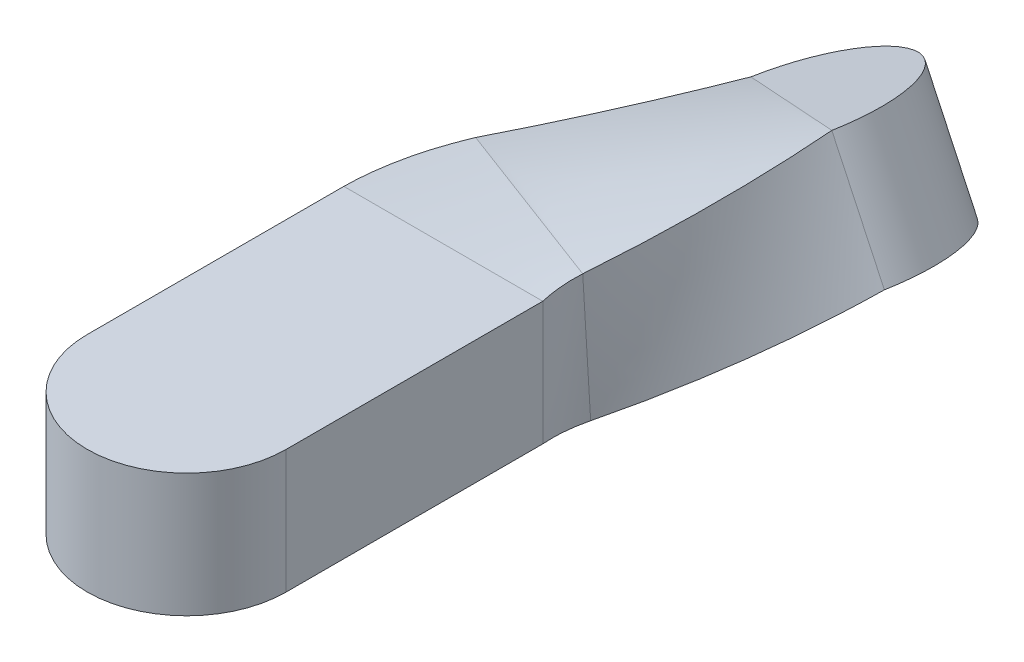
ISO-10303-21;
HEADER;
FILE_DESCRIPTION(('STEP AP214'),'2;1');
FILE_NAME('part.step','',(''),(''),'','','');
FILE_SCHEMA(('AUTOMOTIVE_DESIGN { 1 0 10303 214 1 1 1 1 }'));
ENDSEC;
DATA;
#1=APPLICATION_CONTEXT('core data for automotive mechanical design processes');
#2=APPLICATION_PROTOCOL_DEFINITION('international standard','automotive_design',2000,#1);
#3=PRODUCT_CONTEXT('',#1,'mechanical');
#4=PRODUCT('Part','Part','',(#3));
#5=PRODUCT_RELATED_PRODUCT_CATEGORY('part','',(#4));
#6=PRODUCT_DEFINITION_FORMATION('','',#4);
#7=PRODUCT_DEFINITION_CONTEXT('part definition',#1,'design');
#8=PRODUCT_DEFINITION('design','',#6,#7);
#9=PRODUCT_DEFINITION_SHAPE('','',#8);
#10=(LENGTH_UNIT() NAMED_UNIT(*) SI_UNIT(.MILLI.,.METRE.));
#11=(NAMED_UNIT(*) PLANE_ANGLE_UNIT() SI_UNIT($,.RADIAN.));
#12=(NAMED_UNIT(*) SI_UNIT($,.STERADIAN.) SOLID_ANGLE_UNIT());
#13=UNCERTAINTY_MEASURE_WITH_UNIT(LENGTH_MEASURE(1.E-05),#10,'distance_accuracy_value','');
#14=(GEOMETRIC_REPRESENTATION_CONTEXT(3) GLOBAL_UNCERTAINTY_ASSIGNED_CONTEXT((#13)) GLOBAL_UNIT_ASSIGNED_CONTEXT((#10,
#11,#12)) REPRESENTATION_CONTEXT('',''));
#15=CARTESIAN_POINT('',(0.,0.,0.));
#16=DIRECTION('',(0.,0.,1.));
#17=DIRECTION('',(1.,0.,0.));
#18=AXIS2_PLACEMENT_3D('',#15,#16,#17);
#19=CARTESIAN_POINT('',(4.025,-11.45,-90.8087010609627));
#20=DIRECTION('',(1.,0.,0.));
#21=DIRECTION('',(0.,1.,0.));
#22=AXIS2_PLACEMENT_3D('',#19,#20,#21);
#23=PLANE('',#22);
#24=DIRECTION('',(0.,1.,0.));
#25=VECTOR('',#24,1.);
#26=CARTESIAN_POINT('',(4.025,-11.45,-80.425));
#27=LINE('',#26,#25);
#28=CARTESIAN_POINT('',(4.025,-11.45,-80.425));
#29=VERTEX_POINT('',#28);
#30=CARTESIAN_POINT('',(4.02499999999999,-6.45,-80.425));
#31=VERTEX_POINT('',#30);
#32=EDGE_CURVE('E123',#29,#31,#27,.T.);
#33=ORIENTED_EDGE('',*,*,#32,.F.);
#34=DIRECTION('',(0.,0.,1.));
#35=VECTOR('',#34,1.);
#36=CARTESIAN_POINT('',(4.025,-11.45,-90.8087010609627));
#37=LINE('',#36,#35);
#38=CARTESIAN_POINT('',(4.025,-11.45,-90.8087010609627));
#39=VERTEX_POINT('',#38);
#40=EDGE_CURVE('E11',#39,#29,#37,.T.);
#41=ORIENTED_EDGE('',*,*,#40,.F.);
#42=CARTESIAN_POINT('',(4.02499999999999,-6.45,-90.8087010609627));
#43=CARTESIAN_POINT('',(4.02499999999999,-8.11666666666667,-90.8087010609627));
#44=CARTESIAN_POINT('',(4.025,-9.78333333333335,-90.8087010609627));
#45=CARTESIAN_POINT('',(4.025,-11.45,-90.8087010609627));
#46=B_SPLINE_CURVE_WITH_KNOTS('',3,(#42,#43,#44,#45),.UNSPECIFIED.,.F.,.F.,(4,4),(0.,1.),.UNSPECIFIED.);
#47=CARTESIAN_POINT('',(4.02499999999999,-6.45,-90.8087010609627));
#48=VERTEX_POINT('',#47);
#49=EDGE_CURVE('E122',#39,#48,#46,.F.);
#50=ORIENTED_EDGE('',*,*,#49,.T.);
#51=DIRECTION('',(0.,0.,1.));
#52=VECTOR('',#51,1.);
#53=CARTESIAN_POINT('',(4.02499999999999,-6.45,-90.8087010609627));
#54=LINE('',#53,#52);
#55=EDGE_CURVE('E133',#48,#31,#54,.T.);
#56=ORIENTED_EDGE('',*,*,#55,.T.);
#57=EDGE_LOOP('',(#33,#41,#50,#56));
#58=FACE_BOUND('',#57,.T.);
#59=ADVANCED_FACE('F33',(#58),#23,.T.);
#60=CARTESIAN_POINT('',(-4.025,-11.45,-90.8087010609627));
#61=DIRECTION('',(0.,-1.,0.));
#62=DIRECTION('',(1.,0.,0.));
#63=AXIS2_PLACEMENT_3D('',#60,#61,#62);
#64=PLANE('',#63);
#65=ORIENTED_EDGE('',*,*,#40,.T.);
#66=CARTESIAN_POINT('',(0.,-11.45,-80.425));
#67=DIRECTION('',(0.,1.,0.));
#68=DIRECTION('',(-1.,0.,0.));
#69=AXIS2_PLACEMENT_3D('',#66,#67,#68);
#70=CIRCLE('',#69,4.025);
#71=CARTESIAN_POINT('',(-4.025,-11.45,-80.425));
#72=VERTEX_POINT('',#71);
#73=EDGE_CURVE('E137',#72,#29,#70,.T.);
#74=ORIENTED_EDGE('',*,*,#73,.F.);
#75=DIRECTION('',(0.,0.,1.));
#76=VECTOR('',#75,1.);
#77=CARTESIAN_POINT('',(-4.025,-11.45,-90.8087010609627));
#78=LINE('',#77,#76);
#79=CARTESIAN_POINT('',(-4.025,-11.45,-90.8087010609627));
#80=VERTEX_POINT('',#79);
#81=EDGE_CURVE('E43',#80,#72,#78,.T.);
#82=ORIENTED_EDGE('',*,*,#81,.F.);
#83=CARTESIAN_POINT('',(4.025,-11.45,-90.8087010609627));
#84=CARTESIAN_POINT('',(1.34166666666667,-11.45,-90.8087010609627));
#85=CARTESIAN_POINT('',(-1.34166666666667,-11.45,-90.8087010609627));
#86=CARTESIAN_POINT('',(-4.025,-11.45,-90.8087010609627));
#87=B_SPLINE_CURVE_WITH_KNOTS('',3,(#83,#84,#85,#86),.UNSPECIFIED.,.F.,.F.,(4,4),(0.,1.),.UNSPECIFIED.);
#88=EDGE_CURVE('E313',#80,#39,#87,.F.);
#89=ORIENTED_EDGE('',*,*,#88,.T.);
#90=EDGE_LOOP('',(#65,#74,#82,#89));
#91=FACE_BOUND('',#90,.T.);
#92=ADVANCED_FACE('F442',(#91),#64,.T.);
#93=CARTESIAN_POINT('',(-4.025,-11.45,-90.8087010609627));
#94=DIRECTION('',(-1.,0.,0.));
#95=DIRECTION('',(0.,0.,1.));
#96=AXIS2_PLACEMENT_3D('',#93,#94,#95);
#97=PLANE('',#96);
#98=DIRECTION('',(0.,-1.,0.));
#99=VECTOR('',#98,1.);
#100=CARTESIAN_POINT('',(-4.025,-11.45,-80.425));
#101=LINE('',#100,#99);
#102=CARTESIAN_POINT('',(-4.025,-6.45000000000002,-80.425));
#103=VERTEX_POINT('',#102);
#104=EDGE_CURVE('E111',#103,#72,#101,.T.);
#105=ORIENTED_EDGE('',*,*,#104,.F.);
#106=DIRECTION('',(0.,0.,1.));
#107=VECTOR('',#106,1.);
#108=CARTESIAN_POINT('',(-4.025,-6.45,-90.8087010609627));
#109=LINE('',#108,#107);
#110=CARTESIAN_POINT('',(-4.025,-6.45,-90.8087010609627));
#111=VERTEX_POINT('',#110);
#112=EDGE_CURVE('E115',#111,#103,#109,.T.);
#113=ORIENTED_EDGE('',*,*,#112,.F.);
#114=CARTESIAN_POINT('',(-4.025,-11.45,-90.8087010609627));
#115=CARTESIAN_POINT('',(-4.025,-9.78333333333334,-90.8087010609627));
#116=CARTESIAN_POINT('',(-4.025,-8.11666666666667,-90.8087010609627));
#117=CARTESIAN_POINT('',(-4.025,-6.45,-90.8087010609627));
#118=B_SPLINE_CURVE_WITH_KNOTS('',3,(#114,#115,#116,#117),.UNSPECIFIED.,.F.,.F.,(4,4),(0.,1.),.UNSPECIFIED.);
#119=EDGE_CURVE('E361',#111,#80,#118,.F.);
#120=ORIENTED_EDGE('',*,*,#119,.T.);
#121=ORIENTED_EDGE('',*,*,#81,.T.);
#122=EDGE_LOOP('',(#105,#113,#120,#121));
#123=FACE_BOUND('',#122,.T.);
#124=ADVANCED_FACE('F113',(#123),#97,.T.);
#125=CARTESIAN_POINT('',(-4.025,-6.45,-90.8087010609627));
#126=DIRECTION('',(0.,1.,0.));
#127=DIRECTION('',(-1.,0.,0.));
#128=AXIS2_PLACEMENT_3D('',#125,#126,#127);
#129=PLANE('',#128);
#130=ORIENTED_EDGE('',*,*,#112,.T.);
#131=CARTESIAN_POINT('',(0.,-6.45000000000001,-80.425));
#132=DIRECTION('',(0.,1.,0.));
#133=DIRECTION('',(-1.,0.,0.));
#134=AXIS2_PLACEMENT_3D('',#131,#132,#133);
#135=CIRCLE('',#134,4.02499999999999);
#136=EDGE_CURVE('E129',#103,#31,#135,.T.);
#137=ORIENTED_EDGE('',*,*,#136,.T.);
#138=ORIENTED_EDGE('',*,*,#55,.F.);
#139=CARTESIAN_POINT('',(-4.025,-6.45,-90.8087010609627));
#140=CARTESIAN_POINT('',(-1.34166666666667,-6.45,-90.8087010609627));
#141=CARTESIAN_POINT('',(1.34166666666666,-6.45,-90.8087010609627));
#142=CARTESIAN_POINT('',(4.02499999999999,-6.45,-90.8087010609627));
#143=B_SPLINE_CURVE_WITH_KNOTS('',3,(#139,#140,#141,#142),.UNSPECIFIED.,.F.,.F.,(4,4),(0.,1.),.UNSPECIFIED.);
#144=EDGE_CURVE('E131',#48,#111,#143,.F.);
#145=ORIENTED_EDGE('',*,*,#144,.T.);
#146=EDGE_LOOP('',(#130,#137,#138,#145));
#147=FACE_BOUND('',#146,.T.);
#148=ADVANCED_FACE('F127',(#147),#129,.T.);
#149=CARTESIAN_POINT('',(-3.29638967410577,-6.67502698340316,-95.4131763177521));
#150=CARTESIAN_POINT('',(-3.82171973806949,-6.62495802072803,-93.9925323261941));
#151=CARTESIAN_POINT('',(-4.08845512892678,-6.53373996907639,-92.42721719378));
#152=CARTESIAN_POINT('',(-4.025,-6.45,-90.8087010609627));
#153=CARTESIAN_POINT('',(-0.823158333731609,-6.51616543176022,-94.384503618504));
#154=CARTESIAN_POINT('',(-1.21485130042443,-6.51340910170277,-93.2779823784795));
#155=CARTESIAN_POINT('',(-1.40506565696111,-6.47788863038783,-92.0761100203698));
#156=CARTESIAN_POINT('',(-1.34166666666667,-6.45,-90.8087010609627));
#157=CARTESIAN_POINT('',(1.65007300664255,-6.35730388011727,-93.3558309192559));
#158=CARTESIAN_POINT('',(1.39196207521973,-6.40176205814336,-92.563410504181));
#159=CARTESIAN_POINT('',(1.27837052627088,-6.42215661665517,-91.7249459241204));
#160=CARTESIAN_POINT('',(1.34166666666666,-6.45,-90.8087010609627));
#161=CARTESIAN_POINT('',(4.1233043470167,-6.19844232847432,-92.3271582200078));
#162=CARTESIAN_POINT('',(3.9986012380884,-6.28985338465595,-91.84870249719));
#163=CARTESIAN_POINT('',(3.96194182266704,-6.36678387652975,-91.3737057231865));
#164=CARTESIAN_POINT('',(4.02499999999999,-6.45,-90.8087010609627));
#165=B_SPLINE_SURFACE_WITH_KNOTS('',3,3,((#149,#150,#151,#152),(#153,#154,#155,#156),(#157,#158,
#159,#160),(#161,#162,#163,#164)),.UNSPECIFIED.,.F.,.F.,.F.,(4,4),(4,4),(0.,1.),(0.,1.),.UNSPECIFIED.);
#166=CARTESIAN_POINT('',(4.1233043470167,-6.19844232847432,-92.3271582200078));
#167=CARTESIAN_POINT('',(3.9986012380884,-6.28985338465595,-91.84870249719));
#168=CARTESIAN_POINT('',(3.96194182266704,-6.36678387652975,-91.3737057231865));
#169=CARTESIAN_POINT('',(4.02499999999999,-6.45,-90.8087010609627));
#170=B_SPLINE_CURVE_WITH_KNOTS('',3,(#166,#167,#168,#169),.UNSPECIFIED.,.F.,.F.,(4,4),(0.,1.),.UNSPECIFIED.);
#171=CARTESIAN_POINT('',(4.1233043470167,-6.19844232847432,-92.3271582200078));
#172=VERTEX_POINT('',#171);
#173=EDGE_CURVE('E308',#172,#48,#170,.T.);
#174=DIRECTION('',(0.921701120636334,0.0592030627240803,0.383356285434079));
#175=VECTOR('',#174,1.);
#176=CARTESIAN_POINT('',(-3.29638967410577,-6.67502698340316,-95.4131763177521));
#177=LINE('',#176,#175);
#178=CARTESIAN_POINT('',(-3.29638967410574,-6.67502698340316,-95.4131763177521));
#179=VERTEX_POINT('',#178);
#180=EDGE_CURVE('E408',#179,#172,#177,.T.);
#181=CARTESIAN_POINT('',(-3.29638967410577,-6.67502698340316,-95.4131763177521));
#182=CARTESIAN_POINT('',(-3.82171973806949,-6.62495802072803,-93.9925323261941));
#183=CARTESIAN_POINT('',(-4.08845512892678,-6.53373996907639,-92.42721719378));
#184=CARTESIAN_POINT('',(-4.025,-6.45,-90.8087010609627));
#185=B_SPLINE_CURVE_WITH_KNOTS('',3,(#181,#182,#183,#184),.UNSPECIFIED.,.F.,.F.,(4,4),(0.,1.),.UNSPECIFIED.);
#186=EDGE_CURVE('E273',#179,#111,#185,.T.);
#187=ORIENTED_EDGE('',*,*,#173,.F.);
#188=ORIENTED_EDGE('',*,*,#180,.F.);
#189=ORIENTED_EDGE('',*,*,#186,.T.);
#190=ORIENTED_EDGE('',*,*,#144,.F.);
#191=EDGE_LOOP('',(#187,#188,#189,#190));
#192=FACE_BOUND('',#191,.T.);
#193=ADVANCED_FACE('F227',(#192),#165,.F.);
#194=CARTESIAN_POINT('',(4.1233043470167,-6.19844232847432,-92.3271582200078));
#195=CARTESIAN_POINT('',(3.9986012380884,-6.28985338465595,-91.84870249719));
#196=CARTESIAN_POINT('',(3.96194182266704,-6.36678387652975,-91.3737057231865));
#197=CARTESIAN_POINT('',(4.02499999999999,-6.45,-90.8087010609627));
#198=CARTESIAN_POINT('',(4.23013844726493,-7.8616814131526,-92.3271589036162));
#199=CARTESIAN_POINT('',(4.06565976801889,-7.95567880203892,-91.8425428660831));
#200=CARTESIAN_POINT('',(3.99640675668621,-8.03347065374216,-91.3673930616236));
#201=CARTESIAN_POINT('',(4.02499999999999,-8.11666666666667,-90.8087010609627));
#202=CARTESIAN_POINT('',(4.33697254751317,-9.5249204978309,-92.3271595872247));
#203=CARTESIAN_POINT('',(4.13269768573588,-9.62150173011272,-91.8364011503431));
#204=CARTESIAN_POINT('',(4.03085475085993,-9.70016148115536,-91.3610564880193));
#205=CARTESIAN_POINT('',(4.025,-9.78333333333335,-90.8087010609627));
#206=CARTESIAN_POINT('',(4.4438066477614,-11.1881595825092,-92.3271602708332));
#207=CARTESIAN_POINT('',(4.19972214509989,-11.2873211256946,-91.8302816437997));
#208=CARTESIAN_POINT('',(4.06528088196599,-11.3668561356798,-91.3546983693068));
#209=CARTESIAN_POINT('',(4.025,-11.45,-90.8087010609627));
#210=B_SPLINE_SURFACE_WITH_KNOTS('',3,3,((#194,#195,#196,#197),(#198,#199,#200,#201),(#202,#203,
#204,#205),(#206,#207,#208,#209)),.UNSPECIFIED.,.F.,.F.,.F.,(4,4),(4,4),(0.,1.),(0.,1.),.UNSPECIFIED.);
#211=CARTESIAN_POINT('',(4.4438066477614,-11.1881595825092,-92.3271602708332));
#212=CARTESIAN_POINT('',(4.19972214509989,-11.2873211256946,-91.8302816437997));
#213=CARTESIAN_POINT('',(4.06528088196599,-11.3668561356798,-91.3546983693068));
#214=CARTESIAN_POINT('',(4.025,-11.45,-90.8087010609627));
#215=B_SPLINE_CURVE_WITH_KNOTS('',3,(#211,#212,#213,#214),.UNSPECIFIED.,.F.,.F.,(4,4),(0.,1.),.UNSPECIFIED.);
#216=CARTESIAN_POINT('',(4.4438066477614,-11.1881595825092,-92.3271602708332));
#217=VERTEX_POINT('',#216);
#218=EDGE_CURVE('E289',#217,#39,#215,.T.);
#219=DIRECTION('',(0.0641004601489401,-0.997943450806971,-4.10165098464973E-07));
#220=VECTOR('',#219,1.);
#221=CARTESIAN_POINT('',(4.1233043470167,-6.19844232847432,-92.3271582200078));
#222=LINE('',#221,#220);
#223=EDGE_CURVE('E405',#172,#217,#222,.T.);
#224=ORIENTED_EDGE('',*,*,#218,.F.);
#225=ORIENTED_EDGE('',*,*,#223,.F.);
#226=ORIENTED_EDGE('',*,*,#173,.T.);
#227=ORIENTED_EDGE('',*,*,#49,.F.);
#228=EDGE_LOOP('',(#224,#225,#226,#227));
#229=FACE_BOUND('',#228,.T.);
#230=ADVANCED_FACE('F239',(#229),#210,.F.);
#231=CARTESIAN_POINT('',(4.4438066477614,-11.1881595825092,-92.3271602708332));
#232=CARTESIAN_POINT('',(4.19972214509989,-11.2873211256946,-91.8302816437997));
#233=CARTESIAN_POINT('',(4.06528088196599,-11.3668561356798,-91.3546983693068));
#234=CARTESIAN_POINT('',(4.025,-11.45,-90.8087010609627));
#235=CARTESIAN_POINT('',(1.97057530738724,-11.3470211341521,-93.3558329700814));
#236=CARTESIAN_POINT('',(1.59261935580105,-11.3992044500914,-92.5446388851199));
#237=CARTESIAN_POINT('',(1.38210431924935,-11.4221775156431,-91.7056693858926));
#238=CARTESIAN_POINT('',(1.34166666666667,-11.45,-90.8087010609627));
#239=CARTESIAN_POINT('',(-0.50265603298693,-11.5058826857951,-94.3845056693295));
#240=CARTESIAN_POINT('',(-1.01439680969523,-11.5108149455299,-93.2590744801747));
#241=CARTESIAN_POINT('',(-1.30115792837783,-11.4778713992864,-92.0567054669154));
#242=CARTESIAN_POINT('',(-1.34166666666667,-11.45,-90.8087010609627));
#243=CARTESIAN_POINT('',(-2.97588737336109,-11.664744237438,-95.4131783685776));
#244=CARTESIAN_POINT('',(-3.62137685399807,-11.6223375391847,-93.9735534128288));
#245=CARTESIAN_POINT('',(-3.98445134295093,-11.5336965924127,-92.4077389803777));
#246=CARTESIAN_POINT('',(-4.025,-11.45,-90.8087010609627));
#247=B_SPLINE_SURFACE_WITH_KNOTS('',3,3,((#231,#232,#233,#234),(#235,#236,#237,#238),(#239,#240,
#241,#242),(#243,#244,#245,#246)),.UNSPECIFIED.,.F.,.F.,.F.,(4,4),(4,4),(0.,1.),(0.,1.),.UNSPECIFIED.);
#248=CARTESIAN_POINT('',(-2.97588737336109,-11.664744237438,-95.4131783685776));
#249=CARTESIAN_POINT('',(-3.62137685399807,-11.6223375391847,-93.9735534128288));
#250=CARTESIAN_POINT('',(-3.98445134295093,-11.5336965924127,-92.4077389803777));
#251=CARTESIAN_POINT('',(-4.025,-11.45,-90.8087010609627));
#252=B_SPLINE_CURVE_WITH_KNOTS('',3,(#248,#249,#250,#251),.UNSPECIFIED.,.F.,.F.,(4,4),(0.,1.),.UNSPECIFIED.);
#253=CARTESIAN_POINT('',(-2.97588737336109,-11.664744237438,-95.4131783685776));
#254=VERTEX_POINT('',#253);
#255=EDGE_CURVE('E388',#254,#80,#252,.T.);
#256=DIRECTION('',(-0.921701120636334,-0.0592030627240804,-0.383356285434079));
#257=VECTOR('',#256,1.);
#258=CARTESIAN_POINT('',(4.4438066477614,-11.1881595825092,-92.3271602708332));
#259=LINE('',#258,#257);
#260=EDGE_CURVE('E407',#217,#254,#259,.T.);
#261=ORIENTED_EDGE('',*,*,#255,.F.);
#262=ORIENTED_EDGE('',*,*,#260,.F.);
#263=ORIENTED_EDGE('',*,*,#218,.T.);
#264=ORIENTED_EDGE('',*,*,#88,.F.);
#265=EDGE_LOOP('',(#261,#262,#263,#264));
#266=FACE_BOUND('',#265,.T.);
#267=ADVANCED_FACE('F319',(#266),#247,.F.);
#268=CARTESIAN_POINT('',(-2.97588737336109,-11.664744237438,-95.4131783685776));
#269=CARTESIAN_POINT('',(-3.62137685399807,-11.6223375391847,-93.9735534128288));
#270=CARTESIAN_POINT('',(-3.98445134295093,-11.5336965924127,-92.4077389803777));
#271=CARTESIAN_POINT('',(-4.025,-11.45,-90.8087010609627));
#272=CARTESIAN_POINT('',(-3.08272147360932,-10.0015051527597,-95.4131776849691));
#273=CARTESIAN_POINT('',(-3.68815477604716,-9.95654213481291,-93.9798475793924));
#274=CARTESIAN_POINT('',(-4.01910717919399,-9.86704606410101,-92.4142617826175));
#275=CARTESIAN_POINT('',(-4.025,-9.78333333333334,-90.8087010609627));
#276=CARTESIAN_POINT('',(-3.18955557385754,-8.33826606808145,-95.4131770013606));
#277=CARTESIAN_POINT('',(-3.75493486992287,-8.29074889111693,-93.9861737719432));
#278=CARTESIAN_POINT('',(-4.05377580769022,-8.20039386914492,-92.4207548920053));
#279=CARTESIAN_POINT('',(-4.025,-8.11666666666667,-90.8087010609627));
#280=CARTESIAN_POINT('',(-3.29638967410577,-6.67502698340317,-95.4131763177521));
#281=CARTESIAN_POINT('',(-3.82171973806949,-6.62495802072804,-93.9925323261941));
#282=CARTESIAN_POINT('',(-4.08845512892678,-6.53373996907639,-92.42721719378));
#283=CARTESIAN_POINT('',(-4.025,-6.45,-90.8087010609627));
#284=B_SPLINE_SURFACE_WITH_KNOTS('',3,3,((#268,#269,#270,#271),(#272,#273,#274,#275),(#276,#277,
#278,#279),(#280,#281,#282,#283)),.UNSPECIFIED.,.F.,.F.,.F.,(4,4),(4,4),(0.,1.),(0.,1.),.UNSPECIFIED.);
#285=DIRECTION('',(-0.0641004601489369,0.997943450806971,4.10165099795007E-07));
#286=VECTOR('',#285,1.);
#287=CARTESIAN_POINT('',(-2.97588737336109,-11.664744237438,-95.4131783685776));
#288=LINE('',#287,#286);
#289=EDGE_CURVE('E193',#254,#179,#288,.T.);
#290=ORIENTED_EDGE('',*,*,#119,.F.);
#291=ORIENTED_EDGE('',*,*,#186,.F.);
#292=ORIENTED_EDGE('',*,*,#289,.F.);
#293=ORIENTED_EDGE('',*,*,#255,.T.);
#294=EDGE_LOOP('',(#290,#291,#292,#293));
#295=FACE_BOUND('',#294,.T.);
#296=ADVANCED_FACE('F163',(#295),#284,.F.);
#297=CARTESIAN_POINT('',(-2.97588737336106,-11.664744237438,-95.4131783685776));
#298=CARTESIAN_POINT('',(-1.51976374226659,-12.0343218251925,-98.2729946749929));
#299=CARTESIAN_POINT('',(0.0327877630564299,-12.1244163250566,-101.162038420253));
#300=CARTESIAN_POINT('',(1.55477784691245,-11.9197612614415,-103.824887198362));
#301=CARTESIAN_POINT('',(-3.08272147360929,-10.0015051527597,-95.4131776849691));
#302=CARTESIAN_POINT('',(-1.83438382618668,-10.384442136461,-98.2705443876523));
#303=CARTESIAN_POINT('',(-0.484854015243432,-10.5261830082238,-101.163381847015));
#304=CARTESIAN_POINT('',(0.846251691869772,-10.4111962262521,-103.824888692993));
#305=CARTESIAN_POINT('',(-3.18955557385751,-8.33826606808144,-95.4131770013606));
#306=CARTESIAN_POINT('',(-2.14901824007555,-8.73456209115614,-98.2680860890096));
#307=CARTESIAN_POINT('',(-1.002483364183,-8.92794411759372,-101.164726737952));
#308=CARTESIAN_POINT('',(0.137725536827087,-8.90263119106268,-103.824890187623));
#309=CARTESIAN_POINT('',(-3.29638967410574,-6.67502698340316,-95.4131763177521));
#310=CARTESIAN_POINT('',(-2.46366640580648,-7.08468101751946,-98.2656158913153));
#311=CARTESIAN_POINT('',(-1.52009936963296,-7.32969987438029,-101.166076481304));
#312=CARTESIAN_POINT('',(-0.570800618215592,-7.39406615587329,-103.824891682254));
#313=B_SPLINE_SURFACE_WITH_KNOTS('',3,3,((#297,#298,#299,#300),(#301,#302,#303,#304),(#305,#306,
#307,#308),(#309,#310,#311,#312)),.UNSPECIFIED.,.F.,.F.,.F.,(4,4),(4,4),(0.,1.),(0.,1.),.UNSPECIFIED.);
#314=CARTESIAN_POINT('',(-3.29638967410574,-6.67502698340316,-95.4131763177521));
#315=CARTESIAN_POINT('',(-2.46366640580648,-7.08468101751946,-98.2656158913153));
#316=CARTESIAN_POINT('',(-1.52009936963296,-7.32969987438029,-101.166076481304));
#317=CARTESIAN_POINT('',(-0.570800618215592,-7.39406615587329,-103.824891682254));
#318=B_SPLINE_CURVE_WITH_KNOTS('',3,(#314,#315,#316,#317),.UNSPECIFIED.,.F.,.F.,(4,4),(0.,1.),.UNSPECIFIED.);
#319=CARTESIAN_POINT('',(-0.57080061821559,-7.39406615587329,-103.824891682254));
#320=VERTEX_POINT('',#319);
#321=EDGE_CURVE('E200',#179,#320,#318,.T.);
#322=CARTESIAN_POINT('',(-0.570800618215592,-7.39406615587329,-103.824891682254));
#323=CARTESIAN_POINT('',(0.137725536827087,-8.90263119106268,-103.824890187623));
#324=CARTESIAN_POINT('',(0.846251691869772,-10.4111962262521,-103.824888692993));
#325=CARTESIAN_POINT('',(1.55477784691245,-11.9197612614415,-103.824887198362));
#326=B_SPLINE_CURVE_WITH_KNOTS('',3,(#322,#323,#324,#325),.UNSPECIFIED.,.F.,.F.,(4,4),(0.,1.),.UNSPECIFIED.);
#327=CARTESIAN_POINT('',(0.725817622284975,-10.1547729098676,-103.824888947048));
#328=VERTEX_POINT('',#327);
#329=EDGE_CURVE('E51',#320,#328,#326,.T.);
#330=DIRECTION('',(-0.425115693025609,0.905139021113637,-8.96778293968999E-07));
#331=VECTOR('',#330,1.);
#332=CARTESIAN_POINT('',(1.55477784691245,-11.9197612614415,-103.824887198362));
#333=LINE('',#332,#331);
#334=CARTESIAN_POINT('',(1.55477784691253,-11.9197612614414,-103.824887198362));
#335=VERTEX_POINT('',#334);
#336=EDGE_CURVE('E37',#335,#328,#333,.T.);
#337=CARTESIAN_POINT('',(-2.97588737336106,-11.664744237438,-95.4131783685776));
#338=CARTESIAN_POINT('',(-1.51976374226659,-12.0343218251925,-98.2729946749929));
#339=CARTESIAN_POINT('',(0.0327877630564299,-12.1244163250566,-101.162038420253));
#340=CARTESIAN_POINT('',(1.55477784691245,-11.9197612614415,-103.824887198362));
#341=B_SPLINE_CURVE_WITH_KNOTS('',3,(#337,#338,#339,#340),.UNSPECIFIED.,.F.,.F.,(4,4),(0.,1.),.UNSPECIFIED.);
#342=EDGE_CURVE('E192',#254,#335,#341,.T.);
#343=ORIENTED_EDGE('',*,*,#321,.T.);
#344=ORIENTED_EDGE('',*,*,#329,.T.);
#345=ORIENTED_EDGE('',*,*,#336,.F.);
#346=ORIENTED_EDGE('',*,*,#342,.F.);
#347=ORIENTED_EDGE('',*,*,#289,.T.);
#348=EDGE_LOOP('',(#343,#344,#345,#346,#347));
#349=FACE_BOUND('',#348,.T.);
#350=ADVANCED_FACE('F150',(#349),#313,.T.);
#351=CARTESIAN_POINT('',(-3.29638967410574,-6.67502698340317,-95.4131763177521));
#352=CARTESIAN_POINT('',(-2.46366640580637,-7.08468101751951,-98.2656158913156));
#353=CARTESIAN_POINT('',(-1.52009936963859,-7.32969987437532,-101.166076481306));
#354=CARTESIAN_POINT('',(-0.570800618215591,-7.39406615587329,-103.824891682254));
#355=CARTESIAN_POINT('',(-0.823158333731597,-6.51616543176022,-94.384503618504));
#356=CARTESIAN_POINT('',(-0.0133642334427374,-6.61849673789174,-97.2290778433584));
#357=CARTESIAN_POINT('',(0.842095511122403,-6.56033609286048,-100.104264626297));
#358=CARTESIAN_POINT('',(1.63771937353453,-6.35679178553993,-102.708299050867));
#359=CARTESIAN_POINT('',(1.65007300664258,-6.35730388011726,-93.3558309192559));
#360=CARTESIAN_POINT('',(2.436916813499,-6.15245360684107,-96.1924312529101));
#361=CARTESIAN_POINT('',(3.20438233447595,-5.79117208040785,-99.0424279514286));
#362=CARTESIAN_POINT('',(3.84623936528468,-5.31951741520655,-101.59170641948));
#363=CARTESIAN_POINT('',(4.12330434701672,-6.19844232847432,-92.3271582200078));
#364=CARTESIAN_POINT('',(4.88718736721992,-5.68658257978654,-95.1557063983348));
#365=CARTESIAN_POINT('',(5.56678791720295,-5.02220489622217,-97.980648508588));
#366=CARTESIAN_POINT('',(6.05475935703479,-4.28224304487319,-100.475113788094));
#367=B_SPLINE_SURFACE_WITH_KNOTS('',3,3,((#351,#352,#353,#354),(#355,#356,#357,#358),(#359,#360,
#361,#362),(#363,#364,#365,#366)),.UNSPECIFIED.,.F.,.F.,.F.,(4,4),(4,4),(0.,1.),(0.,1.),.UNSPECIFIED.);
#368=CARTESIAN_POINT('',(4.12330434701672,-6.19844232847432,-92.3271582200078));
#369=CARTESIAN_POINT('',(4.88718736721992,-5.68658257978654,-95.1557063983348));
#370=CARTESIAN_POINT('',(5.56678791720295,-5.02220489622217,-97.980648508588));
#371=CARTESIAN_POINT('',(6.05475935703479,-4.28224304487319,-100.475113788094));
#372=B_SPLINE_CURVE_WITH_KNOTS('',3,(#368,#369,#370,#371),.UNSPECIFIED.,.F.,.F.,(4,4),(0.,1.),.UNSPECIFIED.);
#373=CARTESIAN_POINT('',(6.05475935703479,-4.28224304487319,-100.475113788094));
#374=VERTEX_POINT('',#373);
#375=EDGE_CURVE('E505',#172,#374,#372,.T.);
#376=DIRECTION('',(0.823050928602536,0.386561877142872,0.416121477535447));
#377=VECTOR('',#376,1.);
#378=CARTESIAN_POINT('',(-0.570800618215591,-7.39406615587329,-103.824891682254));
#379=LINE('',#378,#377);
#380=EDGE_CURVE('E509',#320,#374,#379,.T.);
#381=ORIENTED_EDGE('',*,*,#375,.T.);
#382=ORIENTED_EDGE('',*,*,#380,.F.);
#383=ORIENTED_EDGE('',*,*,#321,.F.);
#384=ORIENTED_EDGE('',*,*,#180,.T.);
#385=EDGE_LOOP('',(#381,#382,#383,#384));
#386=FACE_BOUND('',#385,.T.);
#387=ADVANCED_FACE('F162',(#386),#367,.T.);
#388=CARTESIAN_POINT('',(4.12330434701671,-6.19844232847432,-92.3271582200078));
#389=CARTESIAN_POINT('',(4.88718736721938,-5.68658257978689,-95.1557063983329));
#390=CARTESIAN_POINT('',(5.56678791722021,-5.02220489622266,-97.9806485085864));
#391=CARTESIAN_POINT('',(6.05475935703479,-4.28224304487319,-100.475113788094));
#392=CARTESIAN_POINT('',(4.23013844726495,-7.86168141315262,-92.3271589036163));
#393=CARTESIAN_POINT('',(5.20172143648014,-7.33647019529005,-95.1582971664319));
#394=CARTESIAN_POINT('',(6.0841962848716,-6.62050610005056,-97.979347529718));
#395=CARTESIAN_POINT('',(6.76328551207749,-5.79080808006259,-100.475112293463));
#396=CARTESIAN_POINT('',(4.33697254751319,-9.52492049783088,-92.3271595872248));
#397=CARTESIAN_POINT('',(5.51625950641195,-8.98635963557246,-95.1608753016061));
#398=CARTESIAN_POINT('',(6.60163664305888,-8.21878488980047,-97.9780828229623));
#399=CARTESIAN_POINT('',(7.47181166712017,-7.29937311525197,-100.475110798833));
#400=CARTESIAN_POINT('',(4.44380664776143,-11.1881595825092,-92.3271602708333));
#401=CARTESIAN_POINT('',(5.83080030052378,-10.6362504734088,-95.1634438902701));
#402=CARTESIAN_POINT('',(7.1191117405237,-9.81704264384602,-97.9768413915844));
#403=CARTESIAN_POINT('',(8.18033782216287,-8.80793815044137,-100.475109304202));
#404=B_SPLINE_SURFACE_WITH_KNOTS('',3,3,((#388,#389,#390,#391),(#392,#393,#394,#395),(#396,#397,
#398,#399),(#400,#401,#402,#403)),.UNSPECIFIED.,.F.,.F.,.F.,(4,4),(4,4),(0.,1.),(0.,1.),.UNSPECIFIED.);
#405=CARTESIAN_POINT('',(4.44380664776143,-11.1881595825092,-92.3271602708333));
#406=CARTESIAN_POINT('',(5.83080030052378,-10.6362504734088,-95.1634438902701));
#407=CARTESIAN_POINT('',(7.1191117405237,-9.81704264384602,-97.9768413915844));
#408=CARTESIAN_POINT('',(8.18033782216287,-8.80793815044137,-100.475109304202));
#409=B_SPLINE_CURVE_WITH_KNOTS('',3,(#405,#406,#407,#408),.UNSPECIFIED.,.F.,.F.,(4,4),(0.,1.),.UNSPECIFIED.);
#410=CARTESIAN_POINT('',(8.18033782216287,-8.80793815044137,-100.475109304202));
#411=VERTEX_POINT('',#410);
#412=EDGE_CURVE('E458',#217,#411,#409,.T.);
#413=CARTESIAN_POINT('',(8.18033782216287,-8.80793815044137,-100.475109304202));
#414=CARTESIAN_POINT('',(7.47181166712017,-7.29937311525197,-100.475110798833));
#415=CARTESIAN_POINT('',(6.76328551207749,-5.79080808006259,-100.475112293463));
#416=CARTESIAN_POINT('',(6.05475935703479,-4.28224304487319,-100.475113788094));
#417=B_SPLINE_CURVE_WITH_KNOTS('',3,(#413,#414,#415,#416),.UNSPECIFIED.,.F.,.F.,(4,4),(0.,1.),.UNSPECIFIED.);
#418=CARTESIAN_POINT('',(7.35139582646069,-7.04298861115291,-100.475111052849));
#419=VERTEX_POINT('',#418);
#420=EDGE_CURVE('E60',#419,#411,#417,.F.);
#421=DIRECTION('',(0.425115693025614,-0.905139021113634,8.96778296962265E-07));
#422=VECTOR('',#421,1.);
#423=CARTESIAN_POINT('',(6.05475935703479,-4.28224304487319,-100.475113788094));
#424=LINE('',#423,#422);
#425=EDGE_CURVE('E464',#374,#419,#424,.T.);
#426=ORIENTED_EDGE('',*,*,#412,.T.);
#427=ORIENTED_EDGE('',*,*,#420,.F.);
#428=ORIENTED_EDGE('',*,*,#425,.F.);
#429=ORIENTED_EDGE('',*,*,#375,.F.);
#430=ORIENTED_EDGE('',*,*,#223,.T.);
#431=EDGE_LOOP('',(#426,#427,#428,#429,#430));
#432=FACE_BOUND('',#431,.T.);
#433=ADVANCED_FACE('F605',(#432),#404,.T.);
#434=CARTESIAN_POINT('',(4.44380664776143,-11.1881595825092,-92.3271602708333));
#435=CARTESIAN_POINT('',(5.83080030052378,-10.6362504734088,-95.1634438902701));
#436=CARTESIAN_POINT('',(7.1191117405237,-9.81704264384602,-97.9768413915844));
#437=CARTESIAN_POINT('',(8.18033782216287,-8.80793815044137,-100.475109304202));
#438=CARTESIAN_POINT('',(1.97057530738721,-11.3470211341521,-93.3558329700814));
#439=CARTESIAN_POINT('',(3.38064194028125,-11.1021385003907,-96.200036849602));
#440=CARTESIAN_POINT('',(4.75690928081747,-10.5859845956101,-99.0385530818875));
#441=CARTESIAN_POINT('',(5.97181783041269,-9.84521252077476,-101.591701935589));
#442=CARTESIAN_POINT('',(-0.502656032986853,-11.5058826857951,-94.3845056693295));
#443=CARTESIAN_POINT('',(0.930458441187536,-11.5681709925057,-97.2365617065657));
#444=CARTESIAN_POINT('',(2.39481254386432,-11.3551073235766,-100.100305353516));
#445=CARTESIAN_POINT('',(3.76329783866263,-10.8824868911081,-102.708294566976));
#446=CARTESIAN_POINT('',(-2.97588737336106,-11.664744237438,-95.4131783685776));
#447=CARTESIAN_POINT('',(-1.51976374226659,-12.0343218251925,-98.2729946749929));
#448=CARTESIAN_POINT('',(0.0327877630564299,-12.1244163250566,-101.162038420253));
#449=CARTESIAN_POINT('',(1.55477784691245,-11.9197612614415,-103.824887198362));
#450=B_SPLINE_SURFACE_WITH_KNOTS('',3,3,((#434,#435,#436,#437),(#438,#439,#440,#441),(#442,#443,
#444,#445),(#446,#447,#448,#449)),.UNSPECIFIED.,.F.,.F.,.F.,(4,4),(4,4),(0.,1.),(0.,1.),.UNSPECIFIED.);
#451=DIRECTION('',(-0.823050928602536,-0.38656187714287,-0.416121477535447));
#452=VECTOR('',#451,1.);
#453=CARTESIAN_POINT('',(8.18033782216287,-8.80793815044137,-100.475109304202));
#454=LINE('',#453,#452);
#455=EDGE_CURVE('E461',#411,#335,#454,.T.);
#456=ORIENTED_EDGE('',*,*,#455,.F.);
#457=ORIENTED_EDGE('',*,*,#412,.F.);
#458=ORIENTED_EDGE('',*,*,#260,.T.);
#459=ORIENTED_EDGE('',*,*,#342,.T.);
#460=EDGE_LOOP('',(#456,#457,#458,#459));
#461=FACE_BOUND('',#460,.T.);
#462=ADVANCED_FACE('F240',(#461),#450,.T.);
#463=CARTESIAN_POINT('',(1.55477784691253,-11.9197612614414,-103.824887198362));
#464=DIRECTION('',(-0.425115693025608,0.905139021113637,-8.96778296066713E-07));
#465=DIRECTION('',(-0.905139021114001,-0.425115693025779,0.));
#466=AXIS2_PLACEMENT_3D('',#463,#464,#465);
#467=PLANE('',#466);
#468=CARTESIAN_POINT('',(4.86755783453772,-10.3638497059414,-102.149998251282));
#469=DIRECTION('',(0.425115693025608,-0.905139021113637,8.96778296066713E-07));
#470=DIRECTION('',(0.905139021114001,0.425115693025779,0.));
#471=AXIS2_PLACEMENT_3D('',#468,#469,#470);
#472=CIRCLE('',#471,4.02499999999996);
#473=EDGE_CURVE('E198',#335,#411,#472,.T.);
#474=ORIENTED_EDGE('',*,*,#473,.T.);
#475=ORIENTED_EDGE('',*,*,#455,.T.);
#476=EDGE_LOOP('',(#474,#475));
#477=FACE_BOUND('',#476,.T.);
#478=ADVANCED_FACE('F164',(#477),#467,.F.);
#479=CARTESIAN_POINT('',(4.86755783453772,-10.3638497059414,-102.149998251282));
#480=DIRECTION('',(0.425115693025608,-0.905139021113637,8.96778296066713E-07));
#481=DIRECTION('',(0.905139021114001,0.425115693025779,0.));
#482=AXIS2_PLACEMENT_3D('',#479,#480,#481);
#483=CYLINDRICAL_SURFACE('',#482,4.02499999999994);
#484=CARTESIAN_POINT('',(2.74197936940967,-5.83815460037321,-102.150002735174));
#485=DIRECTION('',(0.425115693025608,-0.905139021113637,8.96778296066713E-07));
#486=DIRECTION('',(0.905139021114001,0.425115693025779,0.));
#487=AXIS2_PLACEMENT_3D('',#484,#485,#486);
#488=CIRCLE('',#487,4.02499999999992);
#489=EDGE_CURVE('E202',#320,#374,#488,.T.);
#490=ORIENTED_EDGE('',*,*,#489,.T.);
#491=ORIENTED_EDGE('',*,*,#425,.T.);
#492=ORIENTED_EDGE('',*,*,#420,.T.);
#493=ORIENTED_EDGE('',*,*,#473,.F.);
#494=ORIENTED_EDGE('',*,*,#336,.T.);
#495=ORIENTED_EDGE('',*,*,#329,.F.);
#496=EDGE_LOOP('',(#490,#491,#492,#493,#494,#495));
#497=FACE_BOUND('',#496,.T.);
#498=ADVANCED_FACE('F165',(#497),#483,.T.);
#499=CARTESIAN_POINT('',(2.74197936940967,-5.83815460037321,-102.150002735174));
#500=DIRECTION('',(0.425115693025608,-0.905139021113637,8.96778296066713E-07));
#501=DIRECTION('',(0.905139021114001,0.425115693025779,0.));
#502=AXIS2_PLACEMENT_3D('',#499,#500,#501);
#503=PLANE('',#502);
#504=ORIENTED_EDGE('',*,*,#380,.T.);
#505=ORIENTED_EDGE('',*,*,#489,.F.);
#506=EDGE_LOOP('',(#504,#505));
#507=FACE_BOUND('',#506,.T.);
#508=ADVANCED_FACE('F523',(#507),#503,.F.);
#509=CARTESIAN_POINT('',(0.,-11.45,-80.425));
#510=DIRECTION('',(0.,1.,0.));
#511=DIRECTION('',(-1.,0.,0.));
#512=AXIS2_PLACEMENT_3D('',#509,#510,#511);
#513=CYLINDRICAL_SURFACE('',#512,4.025);
#514=ORIENTED_EDGE('',*,*,#136,.F.);
#515=ORIENTED_EDGE('',*,*,#104,.T.);
#516=ORIENTED_EDGE('',*,*,#73,.T.);
#517=ORIENTED_EDGE('',*,*,#32,.T.);
#518=EDGE_LOOP('',(#514,#515,#516,#517));
#519=FACE_BOUND('',#518,.T.);
#520=ADVANCED_FACE('F135',(#519),#513,.T.);
#521=CLOSED_SHELL('',(#59,#92,#124,#148,#193,#230,#267,#296,#350,#387,#433,#462,#478,#498,#508,#520));
#522=MANIFOLD_SOLID_BREP('B2',#521);
#523=ADVANCED_BREP_SHAPE_REPRESENTATION('',(#18,#522),#14);
#524=SHAPE_DEFINITION_REPRESENTATION(#9,#523);
ENDSEC;
END-ISO-10303-21;
